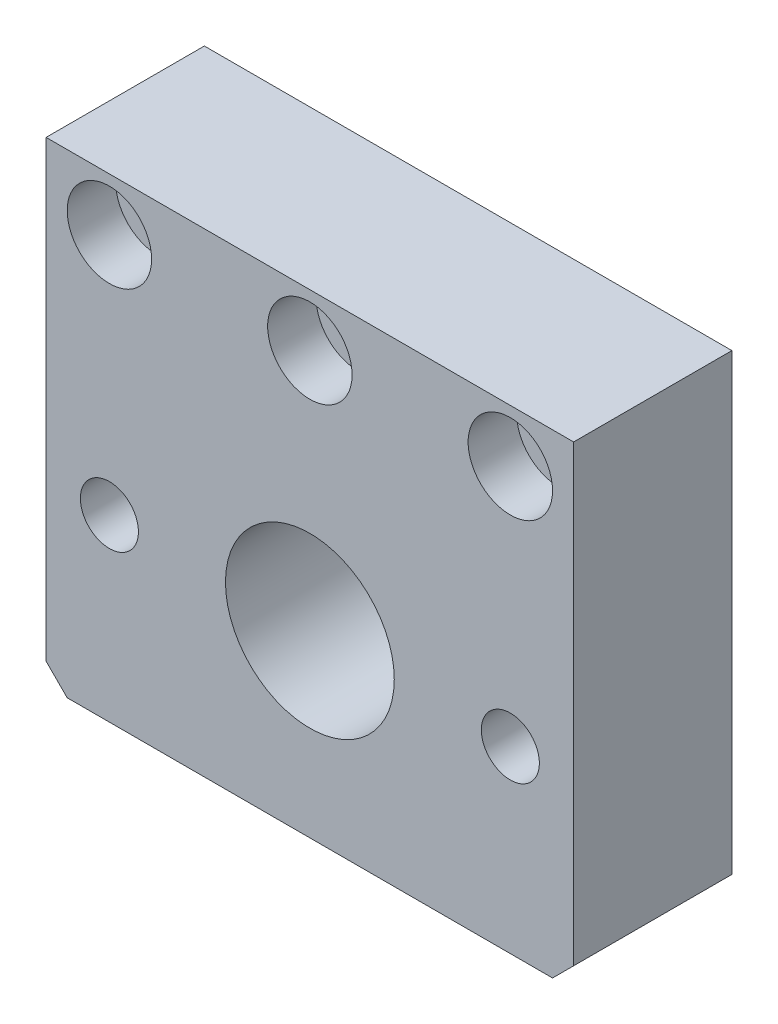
ISO-10303-21;
HEADER;
FILE_DESCRIPTION(('STEP AP214'),'2;1');
FILE_NAME('part.step','',(''),(''),'','','');
FILE_SCHEMA(('AUTOMOTIVE_DESIGN { 1 0 10303 214 1 1 1 1 }'));
ENDSEC;
DATA;
#1=APPLICATION_CONTEXT('core data for automotive mechanical design processes');
#2=APPLICATION_PROTOCOL_DEFINITION('international standard','automotive_design',2000,#1);
#3=PRODUCT_CONTEXT('',#1,'mechanical');
#4=PRODUCT('Part','Part','',(#3));
#5=PRODUCT_RELATED_PRODUCT_CATEGORY('part','',(#4));
#6=PRODUCT_DEFINITION_FORMATION('','',#4);
#7=PRODUCT_DEFINITION_CONTEXT('part definition',#1,'design');
#8=PRODUCT_DEFINITION('design','',#6,#7);
#9=PRODUCT_DEFINITION_SHAPE('','',#8);
#10=(LENGTH_UNIT() NAMED_UNIT(*) SI_UNIT(.MILLI.,.METRE.));
#11=(NAMED_UNIT(*) PLANE_ANGLE_UNIT() SI_UNIT($,.RADIAN.));
#12=(NAMED_UNIT(*) SI_UNIT($,.STERADIAN.) SOLID_ANGLE_UNIT());
#13=UNCERTAINTY_MEASURE_WITH_UNIT(LENGTH_MEASURE(1.E-05),#10,'distance_accuracy_value','');
#14=(GEOMETRIC_REPRESENTATION_CONTEXT(3) GLOBAL_UNCERTAINTY_ASSIGNED_CONTEXT((#13)) GLOBAL_UNIT_ASSIGNED_CONTEXT((#10,
#11,#12)) REPRESENTATION_CONTEXT('',''));
#15=CARTESIAN_POINT('',(0.,0.,0.));
#16=DIRECTION('',(0.,0.,1.));
#17=DIRECTION('',(1.,0.,0.));
#18=AXIS2_PLACEMENT_3D('',#15,#16,#17);
#19=CARTESIAN_POINT('',(-25.,-29.5,-4.));
#20=DIRECTION('',(-1.,0.,0.));
#21=DIRECTION('',(0.,-1.,0.));
#22=AXIS2_PLACEMENT_3D('',#19,#20,#21);
#23=PLANE('',#22);
#24=DIRECTION('',(0.,-1.,0.));
#25=VECTOR('',#24,1.);
#26=CARTESIAN_POINT('',(-25.,-29.5,-4.));
#27=LINE('',#26,#25);
#28=CARTESIAN_POINT('',(-25.,15.5,-4.));
#29=VERTEX_POINT('',#28);
#30=CARTESIAN_POINT('',(-25.,-27.5,-4.));
#31=VERTEX_POINT('',#30);
#32=EDGE_CURVE('E90',#29,#31,#27,.T.);
#33=ORIENTED_EDGE('',*,*,#32,.T.);
#34=DIRECTION('',(0.,0.,1.));
#35=VECTOR('',#34,1.);
#36=CARTESIAN_POINT('',(-25.,-27.5,-4.));
#37=LINE('',#36,#35);
#38=CARTESIAN_POINT('',(-25.,-27.5,11.));
#39=VERTEX_POINT('',#38);
#40=EDGE_CURVE('E100',#31,#39,#37,.T.);
#41=ORIENTED_EDGE('',*,*,#40,.T.);
#42=DIRECTION('',(0.,-1.,0.));
#43=VECTOR('',#42,1.);
#44=CARTESIAN_POINT('',(-25.,-29.5,11.));
#45=LINE('',#44,#43);
#46=CARTESIAN_POINT('',(-25.,15.5,11.));
#47=VERTEX_POINT('',#46);
#48=EDGE_CURVE('E121',#47,#39,#45,.T.);
#49=ORIENTED_EDGE('',*,*,#48,.F.);
#50=DIRECTION('',(0.,0.,1.));
#51=VECTOR('',#50,1.);
#52=CARTESIAN_POINT('',(-25.,15.5,-4.));
#53=LINE('',#52,#51);
#54=EDGE_CURVE('E86',#29,#47,#53,.T.);
#55=ORIENTED_EDGE('',*,*,#54,.F.);
#56=EDGE_LOOP('',(#33,#41,#49,#55));
#57=FACE_BOUND('',#56,.T.);
#58=ADVANCED_FACE('F16',(#57),#23,.T.);
#59=CARTESIAN_POINT('',(-25.,15.5,-4.));
#60=DIRECTION('',(0.,1.,0.));
#61=DIRECTION('',(0.,0.,1.));
#62=AXIS2_PLACEMENT_3D('',#59,#60,#61);
#63=PLANE('',#62);
#64=ORIENTED_EDGE('',*,*,#54,.T.);
#65=DIRECTION('',(-1.,0.,0.));
#66=VECTOR('',#65,1.);
#67=CARTESIAN_POINT('',(-25.,15.5,11.));
#68=LINE('',#67,#66);
#69=CARTESIAN_POINT('',(25.,15.5,11.));
#70=VERTEX_POINT('',#69);
#71=EDGE_CURVE('E73',#70,#47,#68,.T.);
#72=ORIENTED_EDGE('',*,*,#71,.F.);
#73=DIRECTION('',(0.,0.,1.));
#74=VECTOR('',#73,1.);
#75=CARTESIAN_POINT('',(25.,15.5,-4.));
#76=LINE('',#75,#74);
#77=CARTESIAN_POINT('',(25.,15.5,-4.));
#78=VERTEX_POINT('',#77);
#79=EDGE_CURVE('E80',#78,#70,#76,.T.);
#80=ORIENTED_EDGE('',*,*,#79,.F.);
#81=DIRECTION('',(-1.,0.,0.));
#82=VECTOR('',#81,1.);
#83=CARTESIAN_POINT('',(-25.,15.5,-4.));
#84=LINE('',#83,#82);
#85=EDGE_CURVE('E87',#78,#29,#84,.T.);
#86=ORIENTED_EDGE('',*,*,#85,.T.);
#87=EDGE_LOOP('',(#64,#72,#80,#86));
#88=FACE_BOUND('',#87,.T.);
#89=ADVANCED_FACE('F89',(#88),#63,.T.);
#90=CARTESIAN_POINT('',(25.,15.5,-4.));
#91=DIRECTION('',(1.,0.,0.));
#92=DIRECTION('',(0.,1.,0.));
#93=AXIS2_PLACEMENT_3D('',#90,#91,#92);
#94=PLANE('',#93);
#95=DIRECTION('',(0.,1.,0.));
#96=VECTOR('',#95,1.);
#97=CARTESIAN_POINT('',(25.,15.5,11.));
#98=LINE('',#97,#96);
#99=CARTESIAN_POINT('',(25.,-27.5,11.));
#100=VERTEX_POINT('',#99);
#101=EDGE_CURVE('E68',#100,#70,#98,.T.);
#102=ORIENTED_EDGE('',*,*,#101,.F.);
#103=DIRECTION('',(0.,0.,-1.));
#104=VECTOR('',#103,1.);
#105=CARTESIAN_POINT('',(25.,-27.5,-4.));
#106=LINE('',#105,#104);
#107=CARTESIAN_POINT('',(25.,-27.5,-4.));
#108=VERTEX_POINT('',#107);
#109=EDGE_CURVE('E11',#100,#108,#106,.T.);
#110=ORIENTED_EDGE('',*,*,#109,.T.);
#111=DIRECTION('',(0.,1.,0.));
#112=VECTOR('',#111,1.);
#113=CARTESIAN_POINT('',(25.,15.5,-4.));
#114=LINE('',#113,#112);
#115=EDGE_CURVE('E82',#108,#78,#114,.T.);
#116=ORIENTED_EDGE('',*,*,#115,.T.);
#117=ORIENTED_EDGE('',*,*,#79,.T.);
#118=EDGE_LOOP('',(#102,#110,#116,#117));
#119=FACE_BOUND('',#118,.T.);
#120=ADVANCED_FACE('F81',(#119),#94,.T.);
#121=CARTESIAN_POINT('',(25.,-29.5,-4.));
#122=DIRECTION('',(0.,-1.,0.));
#123=DIRECTION('',(0.,0.,-1.));
#124=AXIS2_PLACEMENT_3D('',#121,#122,#123);
#125=PLANE('',#124);
#126=DIRECTION('',(1.,0.,0.));
#127=VECTOR('',#126,1.);
#128=CARTESIAN_POINT('',(25.,-29.5,11.));
#129=LINE('',#128,#127);
#130=CARTESIAN_POINT('',(-23.,-29.5,11.));
#131=VERTEX_POINT('',#130);
#132=CARTESIAN_POINT('',(23.,-29.5,11.));
#133=VERTEX_POINT('',#132);
#134=EDGE_CURVE('E77',#131,#133,#129,.T.);
#135=ORIENTED_EDGE('',*,*,#134,.F.);
#136=DIRECTION('',(0.,0.,-1.));
#137=VECTOR('',#136,1.);
#138=CARTESIAN_POINT('',(-23.,-29.5,-4.));
#139=LINE('',#138,#137);
#140=CARTESIAN_POINT('',(-23.,-29.5,-4.));
#141=VERTEX_POINT('',#140);
#142=EDGE_CURVE('E110',#131,#141,#139,.T.);
#143=ORIENTED_EDGE('',*,*,#142,.T.);
#144=DIRECTION('',(1.,0.,0.));
#145=VECTOR('',#144,1.);
#146=CARTESIAN_POINT('',(25.,-29.5,-4.));
#147=LINE('',#146,#145);
#148=CARTESIAN_POINT('',(23.,-29.5,-4.));
#149=VERTEX_POINT('',#148);
#150=EDGE_CURVE('E93',#141,#149,#147,.T.);
#151=ORIENTED_EDGE('',*,*,#150,.T.);
#152=DIRECTION('',(0.,0.,1.));
#153=VECTOR('',#152,1.);
#154=CARTESIAN_POINT('',(23.,-29.5,-4.));
#155=LINE('',#154,#153);
#156=EDGE_CURVE('E107',#149,#133,#155,.T.);
#157=ORIENTED_EDGE('',*,*,#156,.T.);
#158=EDGE_LOOP('',(#135,#143,#151,#157));
#159=FACE_BOUND('',#158,.T.);
#160=ADVANCED_FACE('F123',(#159),#125,.T.);
#161=CARTESIAN_POINT('',(-25.,15.5,-4.));
#162=DIRECTION('',(0.,0.,-1.));
#163=DIRECTION('',(-1.,0.,0.));
#164=AXIS2_PLACEMENT_3D('',#161,#162,#163);
#165=PLANE('',#164);
#166=CARTESIAN_POINT('',(-19.,10.5,-4.));
#167=DIRECTION('',(0.,0.,1.));
#168=DIRECTION('',(1.,0.,0.));
#169=AXIS2_PLACEMENT_3D('',#166,#167,#168);
#170=CIRCLE('',#169,2.25);
#171=CARTESIAN_POINT('',(-16.75,10.5,-4.));
#172=VERTEX_POINT('',#171);
#173=EDGE_CURVE('E181',#172,#172,#170,.T.);
#174=ORIENTED_EDGE('',*,*,#173,.T.);
#175=EDGE_LOOP('',(#174));
#176=FACE_BOUND('',#175,.T.);
#177=CARTESIAN_POINT('',(19.,10.5,-4.));
#178=DIRECTION('',(0.,0.,1.));
#179=DIRECTION('',(1.,0.,0.));
#180=AXIS2_PLACEMENT_3D('',#177,#178,#179);
#181=CIRCLE('',#180,2.25);
#182=CARTESIAN_POINT('',(21.25,10.5,-4.));
#183=VERTEX_POINT('',#182);
#184=EDGE_CURVE('E169',#183,#183,#181,.T.);
#185=ORIENTED_EDGE('',*,*,#184,.T.);
#186=EDGE_LOOP('',(#185));
#187=FACE_BOUND('',#186,.T.);
#188=CARTESIAN_POINT('',(0.,10.5,-4.));
#189=DIRECTION('',(0.,0.,1.));
#190=DIRECTION('',(1.,0.,0.));
#191=AXIS2_PLACEMENT_3D('',#188,#189,#190);
#192=CIRCLE('',#191,2.25);
#193=CARTESIAN_POINT('',(2.25,10.5,-4.));
#194=VERTEX_POINT('',#193);
#195=EDGE_CURVE('E157',#194,#194,#192,.T.);
#196=ORIENTED_EDGE('',*,*,#195,.T.);
#197=EDGE_LOOP('',(#196));
#198=FACE_BOUND('',#197,.T.);
#199=CARTESIAN_POINT('',(19.,-12.5,-4.));
#200=DIRECTION('',(0.,0.,-1.));
#201=DIRECTION('',(-1.,0.,0.));
#202=AXIS2_PLACEMENT_3D('',#199,#200,#201);
#203=CIRCLE('',#202,5.);
#204=CARTESIAN_POINT('',(14.,-12.5,-4.));
#205=VERTEX_POINT('',#204);
#206=EDGE_CURVE('E154',#205,#205,#203,.T.);
#207=ORIENTED_EDGE('',*,*,#206,.F.);
#208=EDGE_LOOP('',(#207));
#209=FACE_BOUND('',#208,.T.);
#210=CARTESIAN_POINT('',(-19.,-12.5,-4.));
#211=DIRECTION('',(0.,0.,-1.));
#212=DIRECTION('',(-1.,0.,0.));
#213=AXIS2_PLACEMENT_3D('',#210,#211,#212);
#214=CIRCLE('',#213,5.);
#215=CARTESIAN_POINT('',(-24.,-12.5,-4.));
#216=VERTEX_POINT('',#215);
#217=EDGE_CURVE('E142',#216,#216,#214,.T.);
#218=ORIENTED_EDGE('',*,*,#217,.F.);
#219=EDGE_LOOP('',(#218));
#220=FACE_BOUND('',#219,.T.);
#221=CARTESIAN_POINT('',(0.,-12.5,-4.));
#222=DIRECTION('',(0.,0.,-1.));
#223=DIRECTION('',(-1.,0.,0.));
#224=AXIS2_PLACEMENT_3D('',#221,#222,#223);
#225=CIRCLE('',#224,8.);
#226=CARTESIAN_POINT('',(-8.,-12.5,-4.));
#227=VERTEX_POINT('',#226);
#228=EDGE_CURVE('E125',#227,#227,#225,.T.);
#229=ORIENTED_EDGE('',*,*,#228,.F.);
#230=EDGE_LOOP('',(#229));
#231=FACE_BOUND('',#230,.T.);
#232=ORIENTED_EDGE('',*,*,#150,.F.);
#233=DIRECTION('',(0.707106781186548,-0.707106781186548,0.));
#234=VECTOR('',#233,1.);
#235=CARTESIAN_POINT('',(-46.5,-6.,-4.));
#236=LINE('',#235,#234);
#237=EDGE_CURVE('E24',#141,#31,#236,.F.);
#238=ORIENTED_EDGE('',*,*,#237,.T.);
#239=ORIENTED_EDGE('',*,*,#32,.F.);
#240=ORIENTED_EDGE('',*,*,#85,.F.);
#241=ORIENTED_EDGE('',*,*,#115,.F.);
#242=DIRECTION('',(0.707106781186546,0.707106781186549,0.));
#243=VECTOR('',#242,1.);
#244=CARTESIAN_POINT('',(21.5,-31.,-4.));
#245=LINE('',#244,#243);
#246=EDGE_CURVE('E36',#108,#149,#245,.F.);
#247=ORIENTED_EDGE('',*,*,#246,.T.);
#248=EDGE_LOOP('',(#232,#238,#239,#240,#241,#247));
#249=FACE_BOUND('',#248,.T.);
#250=ADVANCED_FACE('F114',(#176,#187,#198,#209,#220,#231,#249),#165,.T.);
#251=CARTESIAN_POINT('',(-25.,15.5,11.));
#252=DIRECTION('',(0.,0.,-1.));
#253=DIRECTION('',(-1.,0.,0.));
#254=AXIS2_PLACEMENT_3D('',#251,#252,#253);
#255=PLANE('',#254);
#256=CARTESIAN_POINT('',(-19.,10.5,11.));
#257=DIRECTION('',(0.,0.,1.));
#258=DIRECTION('',(1.,0.,0.));
#259=AXIS2_PLACEMENT_3D('',#256,#257,#258);
#260=CIRCLE('',#259,4.);
#261=CARTESIAN_POINT('',(-15.,10.5,11.));
#262=VERTEX_POINT('',#261);
#263=EDGE_CURVE('E190',#262,#262,#260,.T.);
#264=ORIENTED_EDGE('',*,*,#263,.F.);
#265=EDGE_LOOP('',(#264));
#266=FACE_BOUND('',#265,.T.);
#267=CARTESIAN_POINT('',(19.,10.5,11.));
#268=DIRECTION('',(0.,0.,1.));
#269=DIRECTION('',(1.,0.,0.));
#270=AXIS2_PLACEMENT_3D('',#267,#268,#269);
#271=CIRCLE('',#270,4.);
#272=CARTESIAN_POINT('',(23.,10.5,11.));
#273=VERTEX_POINT('',#272);
#274=EDGE_CURVE('E178',#273,#273,#271,.T.);
#275=ORIENTED_EDGE('',*,*,#274,.F.);
#276=EDGE_LOOP('',(#275));
#277=FACE_BOUND('',#276,.T.);
#278=CARTESIAN_POINT('',(0.,10.5,11.));
#279=DIRECTION('',(0.,0.,1.));
#280=DIRECTION('',(1.,0.,0.));
#281=AXIS2_PLACEMENT_3D('',#278,#279,#280);
#282=CIRCLE('',#281,4.);
#283=CARTESIAN_POINT('',(4.,10.5,11.));
#284=VERTEX_POINT('',#283);
#285=EDGE_CURVE('E166',#284,#284,#282,.T.);
#286=ORIENTED_EDGE('',*,*,#285,.F.);
#287=EDGE_LOOP('',(#286));
#288=FACE_BOUND('',#287,.T.);
#289=CARTESIAN_POINT('',(19.,-12.5,11.));
#290=DIRECTION('',(0.,0.,-1.));
#291=DIRECTION('',(-1.,0.,0.));
#292=AXIS2_PLACEMENT_3D('',#289,#290,#291);
#293=CIRCLE('',#292,2.75);
#294=CARTESIAN_POINT('',(16.25,-12.5,11.));
#295=VERTEX_POINT('',#294);
#296=EDGE_CURVE('E145',#295,#295,#293,.T.);
#297=ORIENTED_EDGE('',*,*,#296,.T.);
#298=EDGE_LOOP('',(#297));
#299=FACE_BOUND('',#298,.T.);
#300=CARTESIAN_POINT('',(-19.,-12.5,11.));
#301=DIRECTION('',(0.,0.,-1.));
#302=DIRECTION('',(-1.,0.,0.));
#303=AXIS2_PLACEMENT_3D('',#300,#301,#302);
#304=CIRCLE('',#303,2.75);
#305=CARTESIAN_POINT('',(-21.75,-12.5,11.));
#306=VERTEX_POINT('',#305);
#307=EDGE_CURVE('E133',#306,#306,#304,.T.);
#308=ORIENTED_EDGE('',*,*,#307,.T.);
#309=EDGE_LOOP('',(#308));
#310=FACE_BOUND('',#309,.T.);
#311=CARTESIAN_POINT('',(0.,-12.5,11.));
#312=DIRECTION('',(0.,0.,1.));
#313=DIRECTION('',(1.,0.,0.));
#314=AXIS2_PLACEMENT_3D('',#311,#312,#313);
#315=CIRCLE('',#314,8.);
#316=CARTESIAN_POINT('',(8.,-12.5,11.));
#317=VERTEX_POINT('',#316);
#318=EDGE_CURVE('E130',#317,#317,#315,.T.);
#319=ORIENTED_EDGE('',*,*,#318,.F.);
#320=EDGE_LOOP('',(#319));
#321=FACE_BOUND('',#320,.T.);
#322=ORIENTED_EDGE('',*,*,#48,.T.);
#323=DIRECTION('',(-0.707106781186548,0.707106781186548,0.));
#324=VECTOR('',#323,1.);
#325=CARTESIAN_POINT('',(-25.,-27.5,11.));
#326=LINE('',#325,#324);
#327=EDGE_CURVE('E105',#39,#131,#326,.F.);
#328=ORIENTED_EDGE('',*,*,#327,.T.);
#329=ORIENTED_EDGE('',*,*,#134,.T.);
#330=DIRECTION('',(-0.707106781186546,-0.707106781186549,0.));
#331=VECTOR('',#330,1.);
#332=CARTESIAN_POINT('',(23.,-29.5,11.));
#333=LINE('',#332,#331);
#334=EDGE_CURVE('E76',#133,#100,#333,.F.);
#335=ORIENTED_EDGE('',*,*,#334,.T.);
#336=ORIENTED_EDGE('',*,*,#101,.T.);
#337=ORIENTED_EDGE('',*,*,#71,.T.);
#338=EDGE_LOOP('',(#322,#328,#329,#335,#336,#337));
#339=FACE_BOUND('',#338,.T.);
#340=ADVANCED_FACE('F71',(#266,#277,#288,#299,#310,#321,#339),#255,.F.);
#341=CARTESIAN_POINT('',(0.,-12.5,11.));
#342=DIRECTION('',(0.,0.,1.));
#343=DIRECTION('',(1.,0.,0.));
#344=AXIS2_PLACEMENT_3D('',#341,#342,#343);
#345=CYLINDRICAL_SURFACE('',#344,8.);
#346=ORIENTED_EDGE('',*,*,#318,.T.);
#347=EDGE_LOOP('',(#346));
#348=FACE_BOUND('',#347,.T.);
#349=ORIENTED_EDGE('',*,*,#228,.T.);
#350=EDGE_LOOP('',(#349));
#351=FACE_BOUND('',#350,.T.);
#352=ADVANCED_FACE('F198',(#348,#351),#345,.F.);
#353=CARTESIAN_POINT('',(-19.,-12.5,-4.));
#354=DIRECTION('',(0.,0.,-1.));
#355=DIRECTION('',(-1.,0.,0.));
#356=AXIS2_PLACEMENT_3D('',#353,#354,#355);
#357=CYLINDRICAL_SURFACE('',#356,2.75);
#358=ORIENTED_EDGE('',*,*,#307,.F.);
#359=EDGE_LOOP('',(#358));
#360=FACE_BOUND('',#359,.T.);
#361=CARTESIAN_POINT('',(-19.,-12.5,1.7));
#362=DIRECTION('',(0.,0.,-1.));
#363=DIRECTION('',(-1.,0.,0.));
#364=AXIS2_PLACEMENT_3D('',#361,#362,#363);
#365=CIRCLE('',#364,2.75);
#366=CARTESIAN_POINT('',(-21.75,-12.5,1.7));
#367=VERTEX_POINT('',#366);
#368=EDGE_CURVE('E136',#367,#367,#365,.T.);
#369=ORIENTED_EDGE('',*,*,#368,.T.);
#370=EDGE_LOOP('',(#369));
#371=FACE_BOUND('',#370,.T.);
#372=ADVANCED_FACE('F212',(#360,#371),#357,.F.);
#373=CARTESIAN_POINT('',(-16.25,-12.5,1.7));
#374=DIRECTION('',(0.,0.,1.));
#375=DIRECTION('',(1.,0.,0.));
#376=AXIS2_PLACEMENT_3D('',#373,#374,#375);
#377=PLANE('',#376);
#378=ORIENTED_EDGE('',*,*,#368,.F.);
#379=EDGE_LOOP('',(#378));
#380=FACE_BOUND('',#379,.T.);
#381=CARTESIAN_POINT('',(-19.,-12.5,1.7));
#382=DIRECTION('',(0.,0.,-1.));
#383=DIRECTION('',(-1.,0.,0.));
#384=AXIS2_PLACEMENT_3D('',#381,#382,#383);
#385=CIRCLE('',#384,5.);
#386=CARTESIAN_POINT('',(-24.,-12.5,1.7));
#387=VERTEX_POINT('',#386);
#388=EDGE_CURVE('E139',#387,#387,#385,.T.);
#389=ORIENTED_EDGE('',*,*,#388,.T.);
#390=EDGE_LOOP('',(#389));
#391=FACE_BOUND('',#390,.T.);
#392=ADVANCED_FACE('F295',(#380,#391),#377,.F.);
#393=CARTESIAN_POINT('',(-19.,-12.5,-4.));
#394=DIRECTION('',(0.,0.,-1.));
#395=DIRECTION('',(-1.,0.,0.));
#396=AXIS2_PLACEMENT_3D('',#393,#394,#395);
#397=CYLINDRICAL_SURFACE('',#396,5.);
#398=ORIENTED_EDGE('',*,*,#388,.F.);
#399=EDGE_LOOP('',(#398));
#400=FACE_BOUND('',#399,.T.);
#401=ORIENTED_EDGE('',*,*,#217,.T.);
#402=EDGE_LOOP('',(#401));
#403=FACE_BOUND('',#402,.T.);
#404=ADVANCED_FACE('F291',(#400,#403),#397,.F.);
#405=CARTESIAN_POINT('',(19.,-12.5,-4.));
#406=DIRECTION('',(0.,0.,-1.));
#407=DIRECTION('',(-1.,0.,0.));
#408=AXIS2_PLACEMENT_3D('',#405,#406,#407);
#409=CYLINDRICAL_SURFACE('',#408,2.75);
#410=ORIENTED_EDGE('',*,*,#296,.F.);
#411=EDGE_LOOP('',(#410));
#412=FACE_BOUND('',#411,.T.);
#413=CARTESIAN_POINT('',(19.,-12.5,1.7));
#414=DIRECTION('',(0.,0.,-1.));
#415=DIRECTION('',(-1.,0.,0.));
#416=AXIS2_PLACEMENT_3D('',#413,#414,#415);
#417=CIRCLE('',#416,2.75);
#418=CARTESIAN_POINT('',(16.25,-12.5,1.7));
#419=VERTEX_POINT('',#418);
#420=EDGE_CURVE('E148',#419,#419,#417,.T.);
#421=ORIENTED_EDGE('',*,*,#420,.T.);
#422=EDGE_LOOP('',(#421));
#423=FACE_BOUND('',#422,.T.);
#424=ADVANCED_FACE('F287',(#412,#423),#409,.F.);
#425=CARTESIAN_POINT('',(21.75,-12.5,1.7));
#426=DIRECTION('',(0.,0.,1.));
#427=DIRECTION('',(1.,0.,0.));
#428=AXIS2_PLACEMENT_3D('',#425,#426,#427);
#429=PLANE('',#428);
#430=ORIENTED_EDGE('',*,*,#420,.F.);
#431=EDGE_LOOP('',(#430));
#432=FACE_BOUND('',#431,.T.);
#433=CARTESIAN_POINT('',(19.,-12.5,1.7));
#434=DIRECTION('',(0.,0.,-1.));
#435=DIRECTION('',(-1.,0.,0.));
#436=AXIS2_PLACEMENT_3D('',#433,#434,#435);
#437=CIRCLE('',#436,5.);
#438=CARTESIAN_POINT('',(14.,-12.5,1.7));
#439=VERTEX_POINT('',#438);
#440=EDGE_CURVE('E151',#439,#439,#437,.T.);
#441=ORIENTED_EDGE('',*,*,#440,.T.);
#442=EDGE_LOOP('',(#441));
#443=FACE_BOUND('',#442,.T.);
#444=ADVANCED_FACE('F283',(#432,#443),#429,.F.);
#445=CARTESIAN_POINT('',(19.,-12.5,-4.));
#446=DIRECTION('',(0.,0.,-1.));
#447=DIRECTION('',(-1.,0.,0.));
#448=AXIS2_PLACEMENT_3D('',#445,#446,#447);
#449=CYLINDRICAL_SURFACE('',#448,5.);
#450=ORIENTED_EDGE('',*,*,#440,.F.);
#451=EDGE_LOOP('',(#450));
#452=FACE_BOUND('',#451,.T.);
#453=ORIENTED_EDGE('',*,*,#206,.T.);
#454=EDGE_LOOP('',(#453));
#455=FACE_BOUND('',#454,.T.);
#456=ADVANCED_FACE('F279',(#452,#455),#449,.F.);
#457=CARTESIAN_POINT('',(0.,10.5,11.));
#458=DIRECTION('',(0.,0.,1.));
#459=DIRECTION('',(1.,0.,0.));
#460=AXIS2_PLACEMENT_3D('',#457,#458,#459);
#461=CYLINDRICAL_SURFACE('',#460,2.25);
#462=ORIENTED_EDGE('',*,*,#195,.F.);
#463=EDGE_LOOP('',(#462));
#464=FACE_BOUND('',#463,.T.);
#465=CARTESIAN_POINT('',(0.,10.5,6.4));
#466=DIRECTION('',(0.,0.,1.));
#467=DIRECTION('',(1.,0.,0.));
#468=AXIS2_PLACEMENT_3D('',#465,#466,#467);
#469=CIRCLE('',#468,2.25);
#470=CARTESIAN_POINT('',(2.25,10.5,6.4));
#471=VERTEX_POINT('',#470);
#472=EDGE_CURVE('E160',#471,#471,#469,.T.);
#473=ORIENTED_EDGE('',*,*,#472,.T.);
#474=EDGE_LOOP('',(#473));
#475=FACE_BOUND('',#474,.T.);
#476=ADVANCED_FACE('F275',(#464,#475),#461,.F.);
#477=CARTESIAN_POINT('',(2.25,10.5,6.4));
#478=DIRECTION('',(0.,0.,-1.));
#479=DIRECTION('',(-1.,0.,0.));
#480=AXIS2_PLACEMENT_3D('',#477,#478,#479);
#481=PLANE('',#480);
#482=ORIENTED_EDGE('',*,*,#472,.F.);
#483=EDGE_LOOP('',(#482));
#484=FACE_BOUND('',#483,.T.);
#485=CARTESIAN_POINT('',(0.,10.5,6.4));
#486=DIRECTION('',(0.,0.,1.));
#487=DIRECTION('',(1.,0.,0.));
#488=AXIS2_PLACEMENT_3D('',#485,#486,#487);
#489=CIRCLE('',#488,4.);
#490=CARTESIAN_POINT('',(4.,10.5,6.4));
#491=VERTEX_POINT('',#490);
#492=EDGE_CURVE('E163',#491,#491,#489,.T.);
#493=ORIENTED_EDGE('',*,*,#492,.T.);
#494=EDGE_LOOP('',(#493));
#495=FACE_BOUND('',#494,.T.);
#496=ADVANCED_FACE('F271',(#484,#495),#481,.F.);
#497=CARTESIAN_POINT('',(0.,10.5,11.));
#498=DIRECTION('',(0.,0.,1.));
#499=DIRECTION('',(1.,0.,0.));
#500=AXIS2_PLACEMENT_3D('',#497,#498,#499);
#501=CYLINDRICAL_SURFACE('',#500,4.);
#502=ORIENTED_EDGE('',*,*,#492,.F.);
#503=EDGE_LOOP('',(#502));
#504=FACE_BOUND('',#503,.T.);
#505=ORIENTED_EDGE('',*,*,#285,.T.);
#506=EDGE_LOOP('',(#505));
#507=FACE_BOUND('',#506,.T.);
#508=ADVANCED_FACE('F267',(#504,#507),#501,.F.);
#509=CARTESIAN_POINT('',(19.,10.5,11.));
#510=DIRECTION('',(0.,0.,1.));
#511=DIRECTION('',(1.,0.,0.));
#512=AXIS2_PLACEMENT_3D('',#509,#510,#511);
#513=CYLINDRICAL_SURFACE('',#512,2.25);
#514=ORIENTED_EDGE('',*,*,#184,.F.);
#515=EDGE_LOOP('',(#514));
#516=FACE_BOUND('',#515,.T.);
#517=CARTESIAN_POINT('',(19.,10.5,6.4));
#518=DIRECTION('',(0.,0.,1.));
#519=DIRECTION('',(1.,0.,0.));
#520=AXIS2_PLACEMENT_3D('',#517,#518,#519);
#521=CIRCLE('',#520,2.25);
#522=CARTESIAN_POINT('',(21.25,10.5,6.4));
#523=VERTEX_POINT('',#522);
#524=EDGE_CURVE('E172',#523,#523,#521,.T.);
#525=ORIENTED_EDGE('',*,*,#524,.T.);
#526=EDGE_LOOP('',(#525));
#527=FACE_BOUND('',#526,.T.);
#528=ADVANCED_FACE('F263',(#516,#527),#513,.F.);
#529=CARTESIAN_POINT('',(21.25,10.5,6.4));
#530=DIRECTION('',(0.,0.,-1.));
#531=DIRECTION('',(-1.,0.,0.));
#532=AXIS2_PLACEMENT_3D('',#529,#530,#531);
#533=PLANE('',#532);
#534=ORIENTED_EDGE('',*,*,#524,.F.);
#535=EDGE_LOOP('',(#534));
#536=FACE_BOUND('',#535,.T.);
#537=CARTESIAN_POINT('',(19.,10.5,6.4));
#538=DIRECTION('',(0.,0.,1.));
#539=DIRECTION('',(1.,0.,0.));
#540=AXIS2_PLACEMENT_3D('',#537,#538,#539);
#541=CIRCLE('',#540,4.);
#542=CARTESIAN_POINT('',(23.,10.5,6.4));
#543=VERTEX_POINT('',#542);
#544=EDGE_CURVE('E175',#543,#543,#541,.T.);
#545=ORIENTED_EDGE('',*,*,#544,.T.);
#546=EDGE_LOOP('',(#545));
#547=FACE_BOUND('',#546,.T.);
#548=ADVANCED_FACE('F259',(#536,#547),#533,.F.);
#549=CARTESIAN_POINT('',(19.,10.5,11.));
#550=DIRECTION('',(0.,0.,1.));
#551=DIRECTION('',(1.,0.,0.));
#552=AXIS2_PLACEMENT_3D('',#549,#550,#551);
#553=CYLINDRICAL_SURFACE('',#552,4.);
#554=ORIENTED_EDGE('',*,*,#544,.F.);
#555=EDGE_LOOP('',(#554));
#556=FACE_BOUND('',#555,.T.);
#557=ORIENTED_EDGE('',*,*,#274,.T.);
#558=EDGE_LOOP('',(#557));
#559=FACE_BOUND('',#558,.T.);
#560=ADVANCED_FACE('F255',(#556,#559),#553,.F.);
#561=CARTESIAN_POINT('',(-19.,10.5,11.));
#562=DIRECTION('',(0.,0.,1.));
#563=DIRECTION('',(1.,0.,0.));
#564=AXIS2_PLACEMENT_3D('',#561,#562,#563);
#565=CYLINDRICAL_SURFACE('',#564,2.25);
#566=ORIENTED_EDGE('',*,*,#173,.F.);
#567=EDGE_LOOP('',(#566));
#568=FACE_BOUND('',#567,.T.);
#569=CARTESIAN_POINT('',(-19.,10.5,6.4));
#570=DIRECTION('',(0.,0.,1.));
#571=DIRECTION('',(1.,0.,0.));
#572=AXIS2_PLACEMENT_3D('',#569,#570,#571);
#573=CIRCLE('',#572,2.25);
#574=CARTESIAN_POINT('',(-16.75,10.5,6.4));
#575=VERTEX_POINT('',#574);
#576=EDGE_CURVE('E184',#575,#575,#573,.T.);
#577=ORIENTED_EDGE('',*,*,#576,.T.);
#578=EDGE_LOOP('',(#577));
#579=FACE_BOUND('',#578,.T.);
#580=ADVANCED_FACE('F248',(#568,#579),#565,.F.);
#581=CARTESIAN_POINT('',(-16.75,10.5,6.4));
#582=DIRECTION('',(0.,0.,-1.));
#583=DIRECTION('',(-1.,0.,0.));
#584=AXIS2_PLACEMENT_3D('',#581,#582,#583);
#585=PLANE('',#584);
#586=ORIENTED_EDGE('',*,*,#576,.F.);
#587=EDGE_LOOP('',(#586));
#588=FACE_BOUND('',#587,.T.);
#589=CARTESIAN_POINT('',(-19.,10.5,6.4));
#590=DIRECTION('',(0.,0.,1.));
#591=DIRECTION('',(1.,0.,0.));
#592=AXIS2_PLACEMENT_3D('',#589,#590,#591);
#593=CIRCLE('',#592,4.);
#594=CARTESIAN_POINT('',(-15.,10.5,6.4));
#595=VERTEX_POINT('',#594);
#596=EDGE_CURVE('E187',#595,#595,#593,.T.);
#597=ORIENTED_EDGE('',*,*,#596,.T.);
#598=EDGE_LOOP('',(#597));
#599=FACE_BOUND('',#598,.T.);
#600=ADVANCED_FACE('F241',(#588,#599),#585,.F.);
#601=CARTESIAN_POINT('',(-19.,10.5,11.));
#602=DIRECTION('',(0.,0.,1.));
#603=DIRECTION('',(1.,0.,0.));
#604=AXIS2_PLACEMENT_3D('',#601,#602,#603);
#605=CYLINDRICAL_SURFACE('',#604,4.);
#606=ORIENTED_EDGE('',*,*,#596,.F.);
#607=EDGE_LOOP('',(#606));
#608=FACE_BOUND('',#607,.T.);
#609=ORIENTED_EDGE('',*,*,#263,.T.);
#610=EDGE_LOOP('',(#609));
#611=FACE_BOUND('',#610,.T.);
#612=ADVANCED_FACE('F194',(#608,#611),#605,.F.);
#613=CARTESIAN_POINT('',(-25.,-27.5,-4.));
#614=DIRECTION('',(0.707106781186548,0.707106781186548,0.));
#615=DIRECTION('',(0.,0.,1.));
#616=AXIS2_PLACEMENT_3D('',#613,#614,#615);
#617=PLANE('',#616);
#618=ORIENTED_EDGE('',*,*,#237,.F.);
#619=ORIENTED_EDGE('',*,*,#142,.F.);
#620=ORIENTED_EDGE('',*,*,#327,.F.);
#621=ORIENTED_EDGE('',*,*,#40,.F.);
#622=EDGE_LOOP('',(#618,#619,#620,#621));
#623=FACE_BOUND('',#622,.T.);
#624=ADVANCED_FACE('F119',(#623),#617,.F.);
#625=CARTESIAN_POINT('',(23.,-29.5,-4.));
#626=DIRECTION('',(-0.707106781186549,0.707106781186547,0.));
#627=DIRECTION('',(0.,0.,1.));
#628=AXIS2_PLACEMENT_3D('',#625,#626,#627);
#629=PLANE('',#628);
#630=ORIENTED_EDGE('',*,*,#246,.F.);
#631=ORIENTED_EDGE('',*,*,#109,.F.);
#632=ORIENTED_EDGE('',*,*,#334,.F.);
#633=ORIENTED_EDGE('',*,*,#156,.F.);
#634=EDGE_LOOP('',(#630,#631,#632,#633));
#635=FACE_BOUND('',#634,.T.);
#636=ADVANCED_FACE('F18',(#635),#629,.F.);
#637=CLOSED_SHELL('',(#58,#89,#120,#160,#250,#340,#352,#372,#392,#404,#424,#444,#456,#476,#496,
#508,#528,#548,#560,#580,#600,#612,#624,#636));
#638=MANIFOLD_SOLID_BREP('B1',#637);
#639=ADVANCED_BREP_SHAPE_REPRESENTATION('',(#18,#638),#14);
#640=SHAPE_DEFINITION_REPRESENTATION(#9,#639);
ENDSEC;
END-ISO-10303-21;
